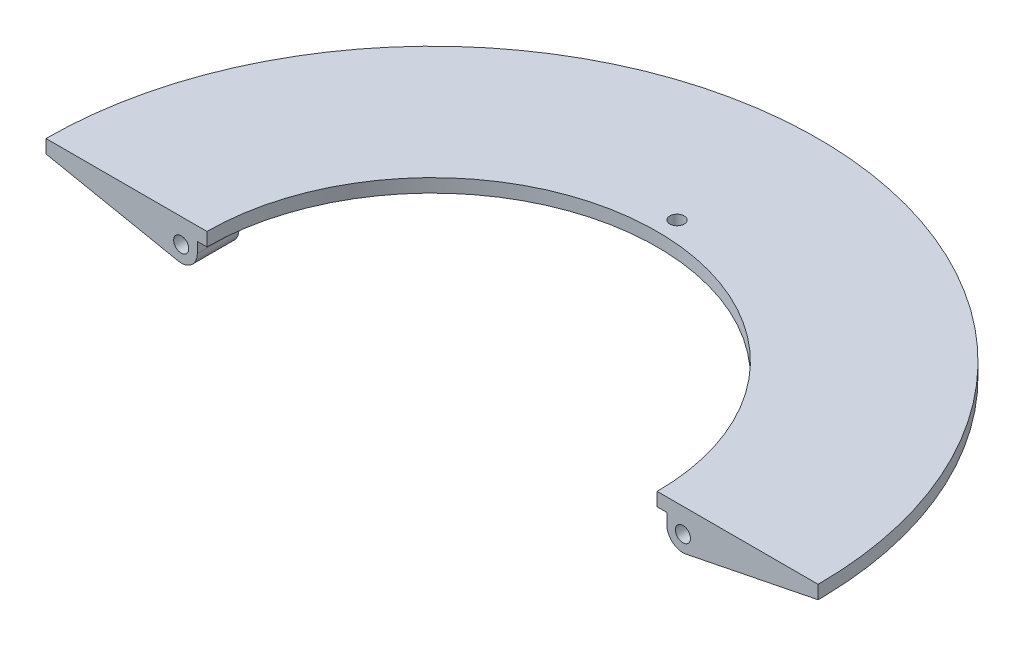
from build123d import *

# Parameters (mm, degrees)
SKETCH1_W                        = 76.2
SKETCH1_H                        = 6.35
REVOLVE1_ANGLE                   = 180
CUT_EXTRUDE3_DEPTH               = 2.54
CIRPATTERN5_COUNT                = 8
CIRPATTERN5_ANGLE                = 157.5
BOSS_EXTRUDE1_DEPTH              = 19.685
BOSS_EXTRUDE3_DEPTH              = 3.81
SKETCH12_R                       = 8.255
BOSS_EXTRUDE2_DEPTH              = 2.54
F_17_64_0_26563_DIAMETER_HOLE1_D = 6.747002
FILLET6_R                        = 3.175
CIRPATTERN6_COUNT                = 6


with BuildPart() as part:
    # Sketch1 → Revolve1 (revolve)
    with BuildSketch(Plane.XY):
        with Locations((-144.6657, -3.175)):
            Rectangle(SKETCH1_W, SKETCH1_H)
    revolve(axis=Axis((0, 0, 0), (0, -1, 0)), revolution_arc=REVOLVE1_ANGLE)

    # Sketch15 → Cut-Extrude3 (cut)
    with BuildSketch(Plane.XZ.offset(6.35)):
        with BuildLine():
            Line((-111.914135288, -40.733414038), (-159.698044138, -58.125334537))
            ThreePointArc((-159.698044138, -58.125334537), (-164.660491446, -57.862227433), (-167.913852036, -54.105799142))
            ThreePointArc((-167.913852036, -54.105799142), (-173.025921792, -34.416995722), (-175.837564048, -14.270608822))
            ThreePointArc((-175.837564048, -14.270608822), (-174.269373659, -9.55511441), (-169.785356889, -7.412988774))
            Line((-169.785356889, -7.412988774), (-118.983181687, -5.194917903))
            ThreePointArc((-118.983181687, -5.194917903), (-114.542399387, -6.744577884), (-112.385987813, -10.924515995))
            ThreePointArc((-112.385987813, -10.924515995), (-110.746056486, -22.028760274), (-108.01174516, -32.915318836))
            ThreePointArc((-108.01174516, -32.915318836), (-108.404416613, -37.602301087), (-111.914135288, -40.733414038))
        make_face()
    cut_extrude3 = extrude(amount=-CUT_EXTRUDE3_DEPTH, mode=Mode.SUBTRACT)

    # CirPattern5: Cut-Extrude3 ×8 about axis
    cirpattern5_axis = Axis((0, 0, 0), (0, -1, 0))
    for i in range(1, CIRPATTERN5_COUNT):
        add(cut_extrude3.rotate(cirpattern5_axis, i * CIRPATTERN5_ANGLE / (CIRPATTERN5_COUNT - 1)), mode=Mode.SUBTRACT)

    # Sketch5 → Boss-Extrude1 (add)
    with BuildSketch(Plane(origin=(0, -10.16, 0), x_dir=(1, 0, 0), z_dir=(0, 0, -1))):
        with BuildLine():
            Line((-126.3777, 1.27), (-126.3777, -6.35))
            Line((-126.3777, -6.35), (-111.1377, -6.35))
            Line((-111.1377, -6.35), (-111.1377, 1.27))
            ThreePointArc((-111.1377, 1.27), (-118.7577, 8.89), (-126.3777, 1.27))
        make_face()
    boss_extrude1 = extrude(amount=BOSS_EXTRUDE1_DEPTH)

    # Sketch9 → 0.28125_ Diameter Hole1 (revolve, cut)
    with BuildSketch(Plane(origin=(-118.7577, -11.43, 0), x_dir=(0, -1, 0), z_dir=(1, 0, 0))):
        Polygon((0, 0), (0, 27.546199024), (3.571875, 25.4), (3.571875, 0), align=None)
    f_0_28125_diameter_hole1 = revolve(axis=Axis((-118.7577, -11.43, 6.35), (0, 0, -1)), mode=Mode.SUBTRACT)

    # Sketch20 → Boss-Extrude3 (add)
    with BuildSketch(Plane.XY):
        with BuildLine():
            Line((-182.7657, -6.35), (-120.257770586, -18.900889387))
            ThreePointArc((-120.257770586, -18.900889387), (-124.652398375, -16.258760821), (-126.3777, -11.43))
            Line((-126.3777, -11.43), (-126.3777, -6.35))
            Line((-126.3777, -6.35), (-182.7657, -6.35))
        make_face()
    boss_extrude3 = extrude(amount=-BOSS_EXTRUDE3_DEPTH)

    # Sketch12 → Boss-Extrude2 (add)
    with BuildSketch(Plane.XZ.offset(3.81)):
        with Locations((0, -115.9637)):
            Circle(SKETCH12_R)
    boss_extrude2 = extrude(amount=BOSS_EXTRUDE2_DEPTH)

    # 17_64 _0.26563_ Diameter Hole1 (through all)
    with Locations(Plane(origin=(0, -6.35, 0), x_dir=(-1, 0, 0), z_dir=(0, -1, 0))):
        with Locations((0, 115.9637)):
            Hole(F_17_64_0_26563_DIAMETER_HOLE1_D / 2)

    # Mirror4: Boss-Extrude1, 0.28125_ Diameter Hole1, Boss-Extrude3 across plane
    add(boss_extrude1.mirror(Plane(origin=(0, 0, 0), x_dir=(0, 0, 1), z_dir=(1, 0, 0))))
    add(f_0_28125_diameter_hole1.mirror(Plane(origin=(0, 0, 0), x_dir=(0, 0, 1), z_dir=(1, 0, 0))), mode=Mode.SUBTRACT)
    add(boss_extrude3.mirror(Plane(origin=(0, 0, 0), x_dir=(0, 0, 1), z_dir=(1, 0, 0))))

    # Fillet6
    fillet6_edges = [part.edges().sort_by_distance(p)[0] for p in [
        (-126.3777, -3.81, -12.601384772),
        (126.3777, -3.81, -12.601384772),
    ]]
    fillet(fillet6_edges, radius=FILLET6_R)

    # CirPattern6: Boss-Extrude2 ×6 about axis, 3 skipped
    cirpattern6_axis = Axis((0, 0, 0), (0, -1, 0))
    add([boss_extrude2.rotate(cirpattern6_axis, i * 360 / CIRPATTERN6_COUNT) for i in range(1, CIRPATTERN6_COUNT) if i not in (2, 3, 4)])


solid = part.part
